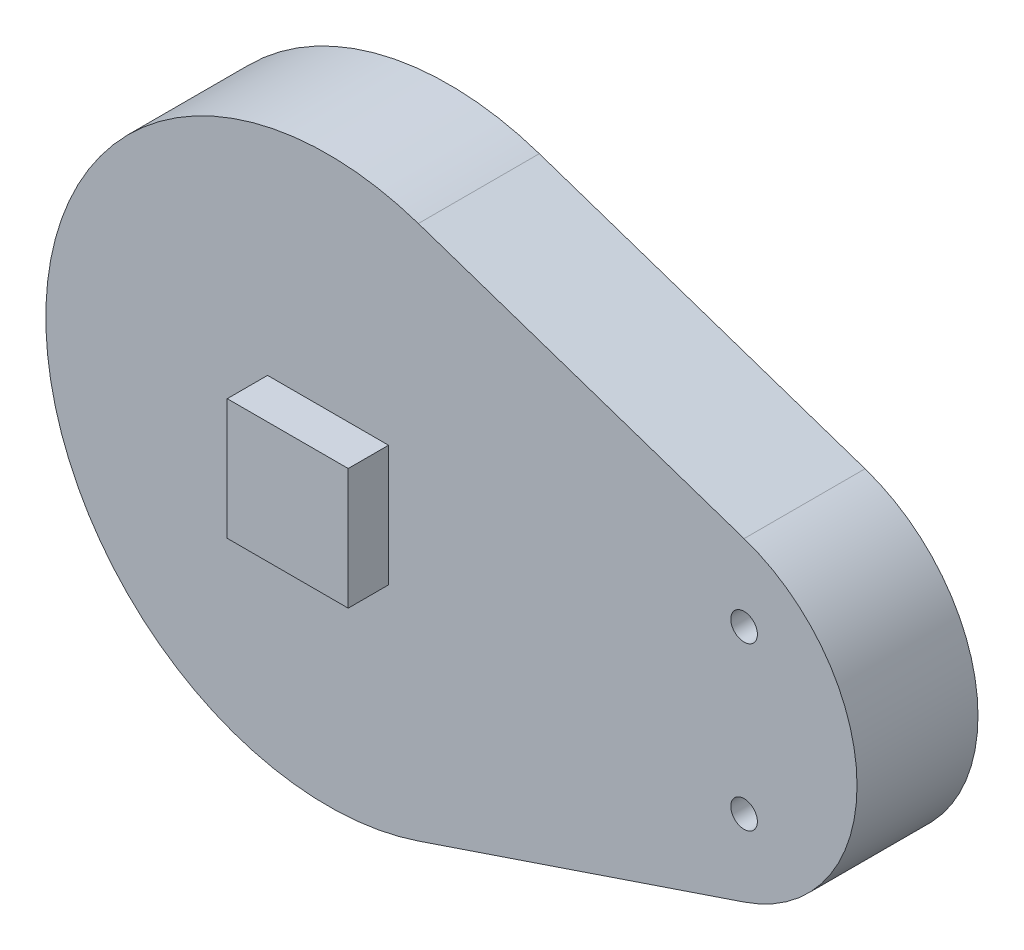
from build123d import *

# Parameters (mm, degrees)
DODANIE_WYCI_GNI_CIE1_DEPTH                       = 30
SZKIC2_W                                          = 30
SZKIC2_H                                          = 30
DODANIE_WYCI_GNI_CIE2_DEPTH                       = 10
SZKIC3_R                                          = 65
DODANIE_WYCI_GNI_CIE3_DEPTH                       = 3
POG_BIENIE_WALCOWE_POD_M6_RUB_Z_BEM_S_D           = 6.6
POG_BIENIE_WALCOWE_POD_M6_RUB_Z_BEM_S_CBORE_D     = 13
POG_BIENIE_WALCOWE_POD_M6_RUB_Z_BEM_S_CBORE_DEPTH = 4.6
POG_BIENIE_WALCOWE_POD_M6_RUB_Z_B_2_D             = 6.6
POG_BIENIE_WALCOWE_POD_M6_RUB_Z_B_2_CBORE_D       = 13
POG_BIENIE_WALCOWE_POD_M6_RUB_Z_B_2_CBORE_DEPTH   = 4.6
ZAOKR_GLENIE2_R                                   = 1
SZKIC8_R                                          = 30
WYTNIJ_WYCI_GNI_CIE1_DEPTH                        = 10


with BuildPart() as part:
    # Szkic1 → Dodanie-wyci_gni_cie1 (new body)
    with BuildSketch(Plane.XY):
        with BuildLine():
            Line((45.032393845, 65.887376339), (-35.751606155, 93.173001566))
            ThreePointArc((-35.751606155, 93.173001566), (-128.151606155, 26.853773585), (-35.751606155, -39.465454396))
            Line((-35.751606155, -39.465454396), (45.032393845, -12.17982917))
            ThreePointArc((45.032393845, -12.17982917), (73.048393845, 26.853773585), (45.032393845, 65.887376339))
        make_face()
    extrude(amount=-DODANIE_WYCI_GNI_CIE1_DEPTH)

    # Szkic2 → Dodanie-wyci_gni_cie2 (add)
    with BuildSketch(Plane.XY):
        with Locations((-58.151606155, 26.853773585)):
            Rectangle(SZKIC2_W, SZKIC2_H)
    extrude(amount=DODANIE_WYCI_GNI_CIE2_DEPTH)

    # Szkic3 → Dodanie-wyci_gni_cie3 (add)
    with BuildSketch(Plane(origin=(0, 0, -30), x_dir=(-1, 0, 0), z_dir=(0, 0, -1))):
        with Locations(Location((58.151606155, 26.853773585, 0), (0, 0, 180))):
            Circle(SZKIC3_R)
    extrude(amount=DODANIE_WYCI_GNI_CIE3_DEPTH)

    # Pog_bienie walcowe pod M6 _rub_ z _bem s (through all)
    with Locations(Plane(origin=(45.032393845, 6.745553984, -30), x_dir=(-1, 0, 0), z_dir=(0, 0, -1))):
        with Locations((0, 0)):
            CounterBoreHole(POG_BIENIE_WALCOWE_POD_M6_RUB_Z_BEM_S_D / 2, POG_BIENIE_WALCOWE_POD_M6_RUB_Z_BEM_S_CBORE_D / 2, POG_BIENIE_WALCOWE_POD_M6_RUB_Z_BEM_S_CBORE_DEPTH)

    # Pog_bienie walcowe pod M6 _rub_ z _b 2 (through all)
    with Locations(Plane(origin=(45.032393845, 46.961993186, -30), x_dir=(-1, 0, 0), z_dir=(0, 0, -1))):
        with Locations((0, 0)):
            CounterBoreHole(POG_BIENIE_WALCOWE_POD_M6_RUB_Z_B_2_D / 2, POG_BIENIE_WALCOWE_POD_M6_RUB_Z_B_2_CBORE_D / 2, POG_BIENIE_WALCOWE_POD_M6_RUB_Z_B_2_CBORE_DEPTH)

    # Zaokr_glenie2
    zaokr_glenie2_edges = [part.edges().sort_by_distance(p)[0] for p in [
        (51.532393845, 6.745553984, -30),
        (51.532393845, 46.961993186, -30),
    ]]
    fillet(zaokr_glenie2_edges, radius=ZAOKR_GLENIE2_R)

    # Szkic8 → Wytnij-wyci_gni_cie1 (cut)
    with BuildSketch(Plane(origin=(0, 0, -33), x_dir=(-1, 0, 0), z_dir=(0, 0, -1))):
        with Locations((58.151606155, 26.853773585)):
            Circle(SZKIC8_R)
    extrude(amount=-WYTNIJ_WYCI_GNI_CIE1_DEPTH, mode=Mode.SUBTRACT)


solid = part.part
